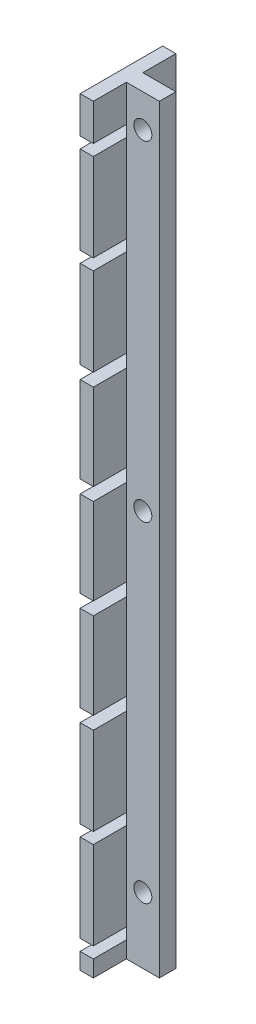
from build123d import *

# Parameters (mm, degrees)
SKETCH1_W           = 6.35
SKETCH1_H           = 146.05
BASE_EXTRUDE_DEPTH  = 3.175
SKETCH2_R           = 1.7272
CUT_EXTRUDE1_DEPTH  = 3.175
SKETCH3_W           = 2.54
SKETCH3_H           = 15.875
BOSS_EXTRUDE3_DEPTH = 146.05
SKETCH4_W           = 2.54
SKETCH4_H           = 2.159
CUT_EXTRUDE2_DEPTH  = 19.05
LPATTERN1_COUNT     = 6
LPATTERN1_PITCH     = 19.05


with BuildPart() as part:
    # Sketch1 → Base-Extrude (new body)
    with BuildSketch(Plane.XY):
        with Locations((-3.175, -447.675)):
            Rectangle(SKETCH1_W, SKETCH1_H)
    extrude(amount=BASE_EXTRUDE_DEPTH)

    # Sketch2 → Cut-Extrude1 (cut)
    with BuildSketch(Plane.XY.offset(3.175)):
        with Locations((-3.175, -508)):
            Circle(SKETCH2_R)
        with Locations((-3.175, -444.5)):
            Circle(SKETCH2_R)
        with Locations((-3.175, -381)):
            Circle(SKETCH2_R)
    extrude(amount=-CUT_EXTRUDE1_DEPTH, mode=Mode.SUBTRACT)

    # Sketch3 → Boss-Extrude3 (add)
    with BuildSketch(Plane(origin=(0, -374.65, 0), x_dir=(-1, 0, 0), z_dir=(0, 1, 0))):
        with Locations((7.62, 1.5875)):
            Rectangle(SKETCH3_W, SKETCH3_H)
    extrude(amount=-BOSS_EXTRUDE3_DEPTH)

    # Sketch4 → Cut-Extrude2 (cut)
    with BuildSketch(Plane.XY.offset(9.525)):
        with Locations((-7.62, -516.4455)):
            Rectangle(SKETCH4_W, SKETCH4_H)
        with Locations((-7.62, -478.028)):
            Rectangle(SKETCH4_W, SKETCH4_H)
    cut_extrude2 = extrude(amount=-CUT_EXTRUDE2_DEPTH, mode=Mode.SUBTRACT)

    # LPattern1: Cut-Extrude2 ×6
    with Locations(*[(0, i * LPATTERN1_PITCH, 0) for i in range(1, LPATTERN1_COUNT)]):
        add(cut_extrude2, mode=Mode.SUBTRACT)


solid = part.part
